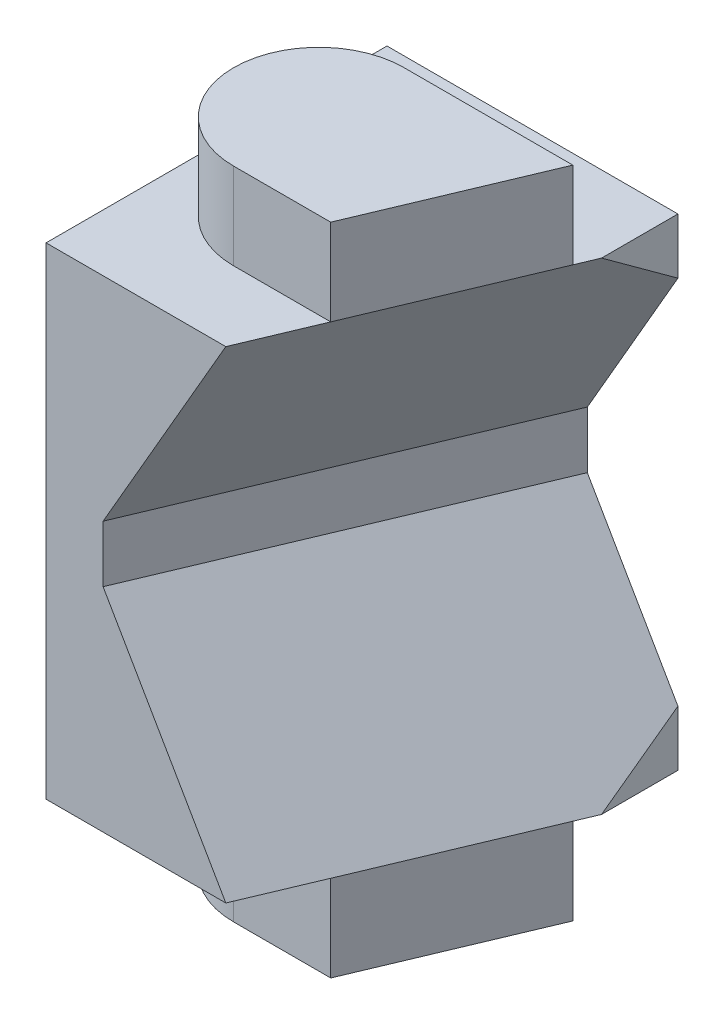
ISO-10303-21;
HEADER;
FILE_DESCRIPTION(('STEP AP214'),'2;1');
FILE_NAME('part.step','',(''),(''),'','','');
FILE_SCHEMA(('AUTOMOTIVE_DESIGN { 1 0 10303 214 1 1 1 1 }'));
ENDSEC;
DATA;
#1=APPLICATION_CONTEXT('core data for automotive mechanical design processes');
#2=APPLICATION_PROTOCOL_DEFINITION('international standard','automotive_design',2000,#1);
#3=PRODUCT_CONTEXT('',#1,'mechanical');
#4=PRODUCT('Part','Part','',(#3));
#5=PRODUCT_RELATED_PRODUCT_CATEGORY('part','',(#4));
#6=PRODUCT_DEFINITION_FORMATION('','',#4);
#7=PRODUCT_DEFINITION_CONTEXT('part definition',#1,'design');
#8=PRODUCT_DEFINITION('design','',#6,#7);
#9=PRODUCT_DEFINITION_SHAPE('','',#8);
#10=(LENGTH_UNIT() NAMED_UNIT(*) SI_UNIT(.MILLI.,.METRE.));
#11=(NAMED_UNIT(*) PLANE_ANGLE_UNIT() SI_UNIT($,.RADIAN.));
#12=(NAMED_UNIT(*) SI_UNIT($,.STERADIAN.) SOLID_ANGLE_UNIT());
#13=UNCERTAINTY_MEASURE_WITH_UNIT(LENGTH_MEASURE(1.E-05),#10,'distance_accuracy_value','');
#14=(GEOMETRIC_REPRESENTATION_CONTEXT(3) GLOBAL_UNCERTAINTY_ASSIGNED_CONTEXT((#13)) GLOBAL_UNIT_ASSIGNED_CONTEXT((#10,
#11,#12)) REPRESENTATION_CONTEXT('',''));
#15=CARTESIAN_POINT('',(0.,0.,0.));
#16=DIRECTION('',(0.,0.,1.));
#17=DIRECTION('',(1.,0.,0.));
#18=AXIS2_PLACEMENT_3D('',#15,#16,#17);
#19=CARTESIAN_POINT('',(0.,10.6,15.));
#20=DIRECTION('',(0.,1.,0.));
#21=DIRECTION('',(1.,0.,0.));
#22=AXIS2_PLACEMENT_3D('',#19,#20,#21);
#23=PLANE('',#22);
#24=CARTESIAN_POINT('',(5.,10.6,8.));
#25=DIRECTION('',(0.,-1.,0.));
#26=DIRECTION('',(-1.,0.,0.));
#27=AXIS2_PLACEMENT_3D('',#24,#25,#26);
#28=CIRCLE('',#27,3.75);
#29=CARTESIAN_POINT('',(5.,10.6,11.75));
#30=VERTEX_POINT('',#29);
#31=CARTESIAN_POINT('',(5.,10.6,4.24999999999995));
#32=VERTEX_POINT('',#31);
#33=EDGE_CURVE('E163',#30,#32,#28,.T.);
#34=ORIENTED_EDGE('',*,*,#33,.T.);
#35=DIRECTION('',(1.,0.,0.));
#36=VECTOR('',#35,1.);
#37=CARTESIAN_POINT('',(5.,10.6,4.24999999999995));
#38=LINE('',#37,#36);
#39=CARTESIAN_POINT('',(12.4259663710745,10.6,4.25));
#40=VERTEX_POINT('',#39);
#41=EDGE_CURVE('E173',#32,#40,#38,.T.);
#42=ORIENTED_EDGE('',*,*,#41,.T.);
#43=DIRECTION('',(-0.38744925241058,0.,0.921891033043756));
#44=VECTOR('',#43,1.);
#45=CARTESIAN_POINT('',(12.8,10.6,3.36002990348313));
#46=LINE('',#45,#44);
#47=CARTESIAN_POINT('',(12.8,10.6,3.36002990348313));
#48=VERTEX_POINT('',#47);
#49=EDGE_CURVE('E247',#48,#40,#46,.T.);
#50=ORIENTED_EDGE('',*,*,#49,.F.);
#51=DIRECTION('',(0.,0.,-1.));
#52=VECTOR('',#51,1.);
#53=CARTESIAN_POINT('',(12.8,10.6,7.35));
#54=LINE('',#53,#52);
#55=CARTESIAN_POINT('',(12.8,10.6,0.));
#56=VERTEX_POINT('',#55);
#57=EDGE_CURVE('E252',#56,#48,#54,.F.);
#58=ORIENTED_EDGE('',*,*,#57,.F.);
#59=DIRECTION('',(1.,0.,0.));
#60=VECTOR('',#59,1.);
#61=CARTESIAN_POINT('',(0.,10.6,0.));
#62=LINE('',#61,#60);
#63=CARTESIAN_POINT('',(0.,10.6,0.));
#64=VERTEX_POINT('',#63);
#65=EDGE_CURVE('E149',#64,#56,#62,.T.);
#66=ORIENTED_EDGE('',*,*,#65,.F.);
#67=DIRECTION('',(0.,0.,-1.));
#68=VECTOR('',#67,1.);
#69=CARTESIAN_POINT('',(0.,10.6,15.));
#70=LINE('',#69,#68);
#71=CARTESIAN_POINT('',(0.,10.6,15.));
#72=VERTEX_POINT('',#71);
#73=EDGE_CURVE('E145',#64,#72,#70,.F.);
#74=ORIENTED_EDGE('',*,*,#73,.T.);
#75=DIRECTION('',(1.,0.,0.));
#76=VECTOR('',#75,1.);
#77=CARTESIAN_POINT('',(0.,10.6,15.));
#78=LINE('',#77,#76);
#79=CARTESIAN_POINT('',(7.90799264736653,10.6,15.));
#80=VERTEX_POINT('',#79);
#81=EDGE_CURVE('E255',#72,#80,#78,.T.);
#82=ORIENTED_EDGE('',*,*,#81,.T.);
#83=CARTESIAN_POINT('',(9.27389168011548,10.6,11.75));
#84=VERTEX_POINT('',#83);
#85=EDGE_CURVE('E250',#84,#80,#46,.T.);
#86=ORIENTED_EDGE('',*,*,#85,.F.);
#87=DIRECTION('',(-1.,0.,0.));
#88=VECTOR('',#87,1.);
#89=CARTESIAN_POINT('',(5.,10.6,11.75));
#90=LINE('',#89,#88);
#91=EDGE_CURVE('E166',#84,#30,#90,.T.);
#92=ORIENTED_EDGE('',*,*,#91,.T.);
#93=EDGE_LOOP('',(#34,#42,#50,#58,#66,#74,#82,#86,#92));
#94=FACE_BOUND('',#93,.T.);
#95=ADVANCED_FACE('F14',(#94),#23,.T.);
#96=CARTESIAN_POINT('',(0.,-10.6,15.));
#97=DIRECTION('',(0.,0.,1.));
#98=DIRECTION('',(-1.,0.,0.));
#99=AXIS2_PLACEMENT_3D('',#96,#97,#98);
#100=PLANE('',#99);
#101=ORIENTED_EDGE('',*,*,#81,.F.);
#102=DIRECTION('',(0.,-1.,0.));
#103=VECTOR('',#102,1.);
#104=CARTESIAN_POINT('',(0.,-10.6,15.));
#105=LINE('',#104,#103);
#106=CARTESIAN_POINT('',(0.,-10.6,15.));
#107=VERTEX_POINT('',#106);
#108=EDGE_CURVE('E222',#72,#107,#105,.T.);
#109=ORIENTED_EDGE('',*,*,#108,.T.);
#110=DIRECTION('',(-1.,0.,0.));
#111=VECTOR('',#110,1.);
#112=CARTESIAN_POINT('',(0.,-10.6,15.));
#113=LINE('',#112,#111);
#114=CARTESIAN_POINT('',(7.90799264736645,-10.6,15.));
#115=VERTEX_POINT('',#114);
#116=EDGE_CURVE('E137',#115,#107,#113,.T.);
#117=ORIENTED_EDGE('',*,*,#116,.F.);
#118=DIRECTION('',(0.5,-0.866025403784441,0.));
#119=VECTOR('',#118,1.);
#120=CARTESIAN_POINT('',(6.9541601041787,-8.94791357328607,15.));
#121=LINE('',#120,#119);
#122=CARTESIAN_POINT('',(2.50847221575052,-1.24775627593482,15.));
#123=VERTEX_POINT('',#122);
#124=EDGE_CURVE('E236',#123,#115,#121,.T.);
#125=ORIENTED_EDGE('',*,*,#124,.F.);
#126=DIRECTION('',(0.,-1.,0.));
#127=VECTOR('',#126,1.);
#128=CARTESIAN_POINT('',(2.5084722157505,-5.92499999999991,15.));
#129=LINE('',#128,#127);
#130=CARTESIAN_POINT('',(2.50847221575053,1.24775627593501,15.));
#131=VERTEX_POINT('',#130);
#132=EDGE_CURVE('E242',#131,#123,#129,.T.);
#133=ORIENTED_EDGE('',*,*,#132,.F.);
#134=DIRECTION('',(-0.5,-0.866025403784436,0.));
#135=VECTOR('',#134,1.);
#136=CARTESIAN_POINT('',(0.434225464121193,-2.34494448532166,15.));
#137=LINE('',#136,#135);
#138=EDGE_CURVE('E245',#80,#131,#137,.T.);
#139=ORIENTED_EDGE('',*,*,#138,.F.);
#140=EDGE_LOOP('',(#101,#109,#117,#125,#133,#139));
#141=FACE_BOUND('',#140,.T.);
#142=ADVANCED_FACE('F285',(#141),#100,.T.);
#143=CARTESIAN_POINT('',(0.,0.,7.35));
#144=DIRECTION('',(1.,0.,0.));
#145=DIRECTION('',(0.,-1.,0.));
#146=AXIS2_PLACEMENT_3D('',#143,#144,#145);
#147=PLANE('',#146);
#148=ORIENTED_EDGE('',*,*,#108,.F.);
#149=ORIENTED_EDGE('',*,*,#73,.F.);
#150=DIRECTION('',(0.,1.,0.));
#151=VECTOR('',#150,1.);
#152=CARTESIAN_POINT('',(0.,-10.6,0.));
#153=LINE('',#152,#151);
#154=CARTESIAN_POINT('',(0.,-10.6,0.));
#155=VERTEX_POINT('',#154);
#156=EDGE_CURVE('E142',#155,#64,#153,.T.);
#157=ORIENTED_EDGE('',*,*,#156,.F.);
#158=DIRECTION('',(0.,0.,-1.));
#159=VECTOR('',#158,1.);
#160=CARTESIAN_POINT('',(0.,-10.6,-0.299999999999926));
#161=LINE('',#160,#159);
#162=EDGE_CURVE('E130',#107,#155,#161,.T.);
#163=ORIENTED_EDGE('',*,*,#162,.F.);
#164=EDGE_LOOP('',(#148,#149,#157,#163));
#165=FACE_BOUND('',#164,.T.);
#166=ADVANCED_FACE('F143',(#165),#147,.F.);
#167=CARTESIAN_POINT('',(12.8,0.,7.35));
#168=DIRECTION('',(1.,0.,0.));
#169=DIRECTION('',(0.,-1.,0.));
#170=AXIS2_PLACEMENT_3D('',#167,#168,#169);
#171=PLANE('',#170);
#172=ORIENTED_EDGE('',*,*,#57,.T.);
#173=DIRECTION('',(0.,0.588524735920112,0.808479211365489));
#174=VECTOR('',#173,1.);
#175=CARTESIAN_POINT('',(12.8,8.29968635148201,0.199999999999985));
#176=LINE('',#175,#174);
#177=CARTESIAN_POINT('',(12.8,8.15409825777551,0.));
#178=VERTEX_POINT('',#177);
#179=EDGE_CURVE('E37',#178,#48,#176,.T.);
#180=ORIENTED_EDGE('',*,*,#179,.F.);
#181=DIRECTION('',(0.,-1.,0.));
#182=VECTOR('',#181,1.);
#183=CARTESIAN_POINT('',(12.8,10.6,0.));
#184=LINE('',#183,#182);
#185=EDGE_CURVE('E159',#56,#178,#184,.T.);
#186=ORIENTED_EDGE('',*,*,#185,.F.);
#187=EDGE_LOOP('',(#172,#180,#186));
#188=FACE_BOUND('',#187,.T.);
#189=ADVANCED_FACE('F337',(#188),#171,.T.);
#190=CARTESIAN_POINT('',(2.84556260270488,-3.73713063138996,7.35));
#191=DIRECTION('',(0.81379768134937,-0.469846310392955,0.342020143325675));
#192=DIRECTION('',(-0.5,-0.866025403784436,0.));
#193=AXIS2_PLACEMENT_3D('',#190,#191,#192);
#194=PLANE('',#193);
#195=ORIENTED_EDGE('',*,*,#138,.T.);
#196=DIRECTION('',(-0.387515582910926,-0.000135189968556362,0.921863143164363));
#197=VECTOR('',#196,1.);
#198=CARTESIAN_POINT('',(8.7298193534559,1.24992667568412,0.20000000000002));
#199=LINE('',#198,#197);
#200=CARTESIAN_POINT('',(8.81389161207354,1.24995600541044,0.));
#201=VERTEX_POINT('',#200);
#202=EDGE_CURVE('E29',#201,#131,#199,.T.);
#203=ORIENTED_EDGE('',*,*,#202,.F.);
#204=DIRECTION('',(0.5,0.866025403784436,0.));
#205=VECTOR('',#204,1.);
#206=CARTESIAN_POINT('',(5.16233750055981,-5.07472124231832,0.));
#207=LINE('',#206,#205);
#208=EDGE_CURVE('E22',#178,#201,#207,.F.);
#209=ORIENTED_EDGE('',*,*,#208,.F.);
#210=ORIENTED_EDGE('',*,*,#179,.T.);
#211=ORIENTED_EDGE('',*,*,#49,.T.);
#212=DIRECTION('',(-0.38744925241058,0.,0.921891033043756));
#213=VECTOR('',#212,1.);
#214=CARTESIAN_POINT('',(12.4259663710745,10.6,4.25));
#215=LINE('',#214,#213);
#216=EDGE_CURVE('E170',#40,#84,#215,.T.);
#217=ORIENTED_EDGE('',*,*,#216,.T.);
#218=ORIENTED_EDGE('',*,*,#85,.T.);
#219=EDGE_LOOP('',(#195,#203,#209,#210,#211,#217,#218));
#220=FACE_BOUND('',#219,.T.);
#221=ADVANCED_FACE('F261',(#220),#194,.T.);
#222=CARTESIAN_POINT('',(5.72423610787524,-5.925,7.35));
#223=DIRECTION('',(0.9218631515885,0.,0.387515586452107));
#224=DIRECTION('',(-0.387515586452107,0.,0.9218631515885));
#225=AXIS2_PLACEMENT_3D('',#222,#223,#224);
#226=PLANE('',#225);
#227=ORIENTED_EDGE('',*,*,#132,.T.);
#228=DIRECTION('',(-0.387515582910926,0.000135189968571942,0.921863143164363));
#229=VECTOR('',#228,1.);
#230=CARTESIAN_POINT('',(8.7298193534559,-1.24992667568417,0.200000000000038));
#231=LINE('',#230,#229);
#232=CARTESIAN_POINT('',(8.81389161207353,-1.24995600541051,0.));
#233=VERTEX_POINT('',#232);
#234=EDGE_CURVE('E239',#233,#123,#231,.T.);
#235=ORIENTED_EDGE('',*,*,#234,.F.);
#236=DIRECTION('',(0.,1.,0.));
#237=VECTOR('',#236,1.);
#238=CARTESIAN_POINT('',(8.81389161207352,-5.925,0.));
#239=LINE('',#238,#237);
#240=EDGE_CURVE('E9',#201,#233,#239,.F.);
#241=ORIENTED_EDGE('',*,*,#240,.F.);
#242=ORIENTED_EDGE('',*,*,#202,.T.);
#243=EDGE_LOOP('',(#227,#235,#241,#242));
#244=FACE_BOUND('',#243,.T.);
#245=ADVANCED_FACE('F287',(#244),#226,.T.);
#246=CARTESIAN_POINT('',(9.36549724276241,-7.55572742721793,7.35000000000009));
#247=DIRECTION('',(0.813797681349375,0.469846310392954,0.342020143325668));
#248=DIRECTION('',(0.5,-0.866025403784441,0.));
#249=AXIS2_PLACEMENT_3D('',#246,#247,#248);
#250=PLANE('',#249);
#251=DIRECTION('',(-0.38744925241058,0.,0.921891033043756));
#252=VECTOR('',#251,1.);
#253=CARTESIAN_POINT('',(12.8,-10.6,3.36002990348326));
#254=LINE('',#253,#252);
#255=CARTESIAN_POINT('',(12.8,-10.6,3.36002990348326));
#256=VERTEX_POINT('',#255);
#257=CARTESIAN_POINT('',(12.4259663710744,-10.6,4.25000000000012));
#258=VERTEX_POINT('',#257);
#259=EDGE_CURVE('E229',#256,#258,#254,.T.);
#260=ORIENTED_EDGE('',*,*,#259,.F.);
#261=DIRECTION('',(0.,-0.588524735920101,0.808479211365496));
#262=VECTOR('',#261,1.);
#263=CARTESIAN_POINT('',(12.8,-8.29968635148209,0.200000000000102));
#264=LINE('',#263,#262);
#265=CARTESIAN_POINT('',(12.8,-8.15409825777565,1.01630724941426E-13));
#266=VERTEX_POINT('',#265);
#267=EDGE_CURVE('E234',#266,#256,#264,.T.);
#268=ORIENTED_EDGE('',*,*,#267,.F.);
#269=DIRECTION('',(0.5,-0.866025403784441,0.));
#270=VECTOR('',#269,1.);
#271=CARTESIAN_POINT('',(1.47923724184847,11.4540380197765,0.));
#272=LINE('',#271,#270);
#273=EDGE_CURVE('E139',#266,#233,#272,.F.);
#274=ORIENTED_EDGE('',*,*,#273,.T.);
#275=ORIENTED_EDGE('',*,*,#234,.T.);
#276=ORIENTED_EDGE('',*,*,#124,.T.);
#277=CARTESIAN_POINT('',(9.27389168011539,-10.6,11.75));
#278=VERTEX_POINT('',#277);
#279=EDGE_CURVE('E231',#278,#115,#254,.T.);
#280=ORIENTED_EDGE('',*,*,#279,.F.);
#281=DIRECTION('',(-0.38744925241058,0.,0.921891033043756));
#282=VECTOR('',#281,1.);
#283=CARTESIAN_POINT('',(12.4259663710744,-10.6,4.25000000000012));
#284=LINE('',#283,#282);
#285=EDGE_CURVE('E203',#258,#278,#284,.T.);
#286=ORIENTED_EDGE('',*,*,#285,.F.);
#287=EDGE_LOOP('',(#260,#268,#274,#275,#276,#280,#286));
#288=FACE_BOUND('',#287,.T.);
#289=ADVANCED_FACE('F290',(#288),#250,.T.);
#290=ORIENTED_EDGE('',*,*,#267,.T.);
#291=DIRECTION('',(0.,0.,-1.));
#292=VECTOR('',#291,1.);
#293=CARTESIAN_POINT('',(12.8,-10.6,-0.299999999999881));
#294=LINE('',#293,#292);
#295=CARTESIAN_POINT('',(12.8,-10.6,1.18710365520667E-13));
#296=VERTEX_POINT('',#295);
#297=EDGE_CURVE('E232',#296,#256,#294,.F.);
#298=ORIENTED_EDGE('',*,*,#297,.F.);
#299=DIRECTION('',(0.,-1.,0.));
#300=VECTOR('',#299,1.);
#301=CARTESIAN_POINT('',(12.8,-8.2996863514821,1.02647361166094E-13));
#302=LINE('',#301,#300);
#303=EDGE_CURVE('E155',#266,#296,#302,.T.);
#304=ORIENTED_EDGE('',*,*,#303,.F.);
#305=EDGE_LOOP('',(#290,#298,#304));
#306=FACE_BOUND('',#305,.T.);
#307=ADVANCED_FACE('F294',(#306),#171,.T.);
#308=CARTESIAN_POINT('',(0.,-10.6,-0.299999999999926));
#309=DIRECTION('',(0.,-1.,0.));
#310=DIRECTION('',(-1.,0.,0.));
#311=AXIS2_PLACEMENT_3D('',#308,#309,#310);
#312=PLANE('',#311);
#313=DIRECTION('',(-1.,0.,0.));
#314=VECTOR('',#313,1.);
#315=CARTESIAN_POINT('',(4.99999999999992,-10.6,11.75));
#316=LINE('',#315,#314);
#317=CARTESIAN_POINT('',(4.99999999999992,-10.6,11.75));
#318=VERTEX_POINT('',#317);
#319=EDGE_CURVE('E206',#278,#318,#316,.T.);
#320=ORIENTED_EDGE('',*,*,#319,.F.);
#321=ORIENTED_EDGE('',*,*,#279,.T.);
#322=ORIENTED_EDGE('',*,*,#116,.T.);
#323=ORIENTED_EDGE('',*,*,#162,.T.);
#324=DIRECTION('',(-1.,0.,0.));
#325=VECTOR('',#324,1.);
#326=CARTESIAN_POINT('',(12.8,-10.6,1.18710365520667E-13));
#327=LINE('',#326,#325);
#328=EDGE_CURVE('E135',#296,#155,#327,.T.);
#329=ORIENTED_EDGE('',*,*,#328,.F.);
#330=ORIENTED_EDGE('',*,*,#297,.T.);
#331=ORIENTED_EDGE('',*,*,#259,.T.);
#332=DIRECTION('',(1.,0.,0.));
#333=VECTOR('',#332,1.);
#334=CARTESIAN_POINT('',(5.,-10.6,4.25000000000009));
#335=LINE('',#334,#333);
#336=CARTESIAN_POINT('',(5.,-10.6,4.25000000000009));
#337=VERTEX_POINT('',#336);
#338=EDGE_CURVE('E199',#337,#258,#335,.T.);
#339=ORIENTED_EDGE('',*,*,#338,.F.);
#340=CARTESIAN_POINT('',(4.99999999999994,-10.6,8.00000000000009));
#341=DIRECTION('',(0.,-1.,0.));
#342=DIRECTION('',(-1.,0.,0.));
#343=AXIS2_PLACEMENT_3D('',#340,#341,#342);
#344=CIRCLE('',#343,3.75);
#345=EDGE_CURVE('E196',#318,#337,#344,.T.);
#346=ORIENTED_EDGE('',*,*,#345,.F.);
#347=EDGE_LOOP('',(#320,#321,#322,#323,#329,#330,#331,#339,#346));
#348=FACE_BOUND('',#347,.T.);
#349=ADVANCED_FACE('F132',(#348),#312,.T.);
#350=CARTESIAN_POINT('',(4.99999999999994,-10.6,8.00000000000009));
#351=DIRECTION('',(0.,-1.,0.));
#352=DIRECTION('',(-1.,0.,0.));
#353=AXIS2_PLACEMENT_3D('',#350,#351,#352);
#354=CYLINDRICAL_SURFACE('',#353,3.75);
#355=CARTESIAN_POINT('',(4.99999999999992,-14.4,8.00000000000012));
#356=DIRECTION('',(0.,-1.,0.));
#357=DIRECTION('',(-1.,0.,0.));
#358=AXIS2_PLACEMENT_3D('',#355,#356,#357);
#359=CIRCLE('',#358,3.75);
#360=CARTESIAN_POINT('',(4.99999999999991,-14.4,11.7500000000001));
#361=VERTEX_POINT('',#360);
#362=CARTESIAN_POINT('',(4.99999999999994,-14.4,4.25000000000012));
#363=VERTEX_POINT('',#362);
#364=EDGE_CURVE('E187',#361,#363,#359,.T.);
#365=ORIENTED_EDGE('',*,*,#364,.F.);
#366=DIRECTION('',(0.,-1.,0.));
#367=VECTOR('',#366,1.);
#368=CARTESIAN_POINT('',(4.99999999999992,-10.6,11.75));
#369=LINE('',#368,#367);
#370=EDGE_CURVE('E220',#318,#361,#369,.T.);
#371=ORIENTED_EDGE('',*,*,#370,.F.);
#372=ORIENTED_EDGE('',*,*,#345,.T.);
#373=DIRECTION('',(0.,-1.,0.));
#374=VECTOR('',#373,1.);
#375=CARTESIAN_POINT('',(5.,-10.6,4.25000000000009));
#376=LINE('',#375,#374);
#377=EDGE_CURVE('E209',#337,#363,#376,.T.);
#378=ORIENTED_EDGE('',*,*,#377,.T.);
#379=EDGE_LOOP('',(#365,#371,#372,#378));
#380=FACE_BOUND('',#379,.T.);
#381=ADVANCED_FACE('F307',(#380),#354,.T.);
#382=CARTESIAN_POINT('',(4.99999999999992,-10.6,11.75));
#383=DIRECTION('',(0.,0.,1.));
#384=DIRECTION('',(-1.,0.,0.));
#385=AXIS2_PLACEMENT_3D('',#382,#383,#384);
#386=PLANE('',#385);
#387=DIRECTION('',(-1.,0.,0.));
#388=VECTOR('',#387,1.);
#389=CARTESIAN_POINT('',(4.99999999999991,-14.4,11.7500000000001));
#390=LINE('',#389,#388);
#391=CARTESIAN_POINT('',(9.27389168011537,-14.4,11.7500000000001));
#392=VERTEX_POINT('',#391);
#393=EDGE_CURVE('E200',#392,#361,#390,.T.);
#394=ORIENTED_EDGE('',*,*,#393,.F.);
#395=DIRECTION('',(0.,-1.,0.));
#396=VECTOR('',#395,1.);
#397=CARTESIAN_POINT('',(9.27389168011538,-10.6,11.75));
#398=LINE('',#397,#396);
#399=EDGE_CURVE('E223',#278,#392,#398,.T.);
#400=ORIENTED_EDGE('',*,*,#399,.F.);
#401=ORIENTED_EDGE('',*,*,#319,.T.);
#402=ORIENTED_EDGE('',*,*,#370,.T.);
#403=EDGE_LOOP('',(#394,#400,#401,#402));
#404=FACE_BOUND('',#403,.T.);
#405=ADVANCED_FACE('F310',(#404),#386,.T.);
#406=CARTESIAN_POINT('',(12.4259663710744,-10.6,4.25000000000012));
#407=DIRECTION('',(0.921891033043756,0.,0.387449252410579));
#408=DIRECTION('',(-0.387449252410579,0.,0.921891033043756));
#409=AXIS2_PLACEMENT_3D('',#406,#407,#408);
#410=PLANE('',#409);
#411=DIRECTION('',(-0.38744925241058,0.,0.921891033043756));
#412=VECTOR('',#411,1.);
#413=CARTESIAN_POINT('',(12.4259663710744,-14.4,4.25000000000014));
#414=LINE('',#413,#412);
#415=CARTESIAN_POINT('',(12.4259663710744,-14.4,4.25000000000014));
#416=VERTEX_POINT('',#415);
#417=EDGE_CURVE('E215',#416,#392,#414,.T.);
#418=ORIENTED_EDGE('',*,*,#417,.F.);
#419=DIRECTION('',(0.,-1.,0.));
#420=VECTOR('',#419,1.);
#421=CARTESIAN_POINT('',(12.4259663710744,-10.6,4.25000000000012));
#422=LINE('',#421,#420);
#423=EDGE_CURVE('E225',#258,#416,#422,.T.);
#424=ORIENTED_EDGE('',*,*,#423,.F.);
#425=ORIENTED_EDGE('',*,*,#285,.T.);
#426=ORIENTED_EDGE('',*,*,#399,.T.);
#427=EDGE_LOOP('',(#418,#424,#425,#426));
#428=FACE_BOUND('',#427,.T.);
#429=ADVANCED_FACE('F300',(#428),#410,.T.);
#430=CARTESIAN_POINT('',(5.,-10.6,4.25000000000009));
#431=DIRECTION('',(0.,0.,-1.));
#432=DIRECTION('',(1.,0.,0.));
#433=AXIS2_PLACEMENT_3D('',#430,#431,#432);
#434=PLANE('',#433);
#435=DIRECTION('',(1.,0.,0.));
#436=VECTOR('',#435,1.);
#437=CARTESIAN_POINT('',(4.99999999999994,-14.4,4.25000000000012));
#438=LINE('',#437,#436);
#439=EDGE_CURVE('E212',#363,#416,#438,.T.);
#440=ORIENTED_EDGE('',*,*,#439,.F.);
#441=ORIENTED_EDGE('',*,*,#377,.F.);
#442=ORIENTED_EDGE('',*,*,#338,.T.);
#443=ORIENTED_EDGE('',*,*,#423,.T.);
#444=EDGE_LOOP('',(#440,#441,#442,#443));
#445=FACE_BOUND('',#444,.T.);
#446=ADVANCED_FACE('F303',(#445),#434,.T.);
#447=CARTESIAN_POINT('',(4.98939776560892,-14.4,8.00000000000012));
#448=DIRECTION('',(0.,-1.,0.));
#449=DIRECTION('',(-1.,0.,0.));
#450=AXIS2_PLACEMENT_3D('',#447,#448,#449);
#451=PLANE('',#450);
#452=ORIENTED_EDGE('',*,*,#364,.T.);
#453=ORIENTED_EDGE('',*,*,#439,.T.);
#454=ORIENTED_EDGE('',*,*,#417,.T.);
#455=ORIENTED_EDGE('',*,*,#393,.T.);
#456=EDGE_LOOP('',(#452,#453,#454,#455));
#457=FACE_BOUND('',#456,.T.);
#458=ADVANCED_FACE('F312',(#457),#451,.T.);
#459=CARTESIAN_POINT('',(5.,10.6,8.));
#460=DIRECTION('',(0.,1.,0.));
#461=DIRECTION('',(1.,0.,0.));
#462=AXIS2_PLACEMENT_3D('',#459,#460,#461);
#463=CYLINDRICAL_SURFACE('',#462,3.75);
#464=CARTESIAN_POINT('',(5.,14.4,8.));
#465=DIRECTION('',(0.,-1.,0.));
#466=DIRECTION('',(-1.,0.,0.));
#467=AXIS2_PLACEMENT_3D('',#464,#465,#466);
#468=CIRCLE('',#467,3.75);
#469=CARTESIAN_POINT('',(5.,14.4,11.75));
#470=VERTEX_POINT('',#469);
#471=CARTESIAN_POINT('',(5.,14.4,4.24999999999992));
#472=VERTEX_POINT('',#471);
#473=EDGE_CURVE('E162',#470,#472,#468,.T.);
#474=ORIENTED_EDGE('',*,*,#473,.T.);
#475=DIRECTION('',(0.,1.,0.));
#476=VECTOR('',#475,1.);
#477=CARTESIAN_POINT('',(5.,10.6,4.24999999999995));
#478=LINE('',#477,#476);
#479=EDGE_CURVE('E184',#32,#472,#478,.T.);
#480=ORIENTED_EDGE('',*,*,#479,.F.);
#481=ORIENTED_EDGE('',*,*,#33,.F.);
#482=DIRECTION('',(0.,1.,0.));
#483=VECTOR('',#482,1.);
#484=CARTESIAN_POINT('',(5.,10.6,11.75));
#485=LINE('',#484,#483);
#486=EDGE_CURVE('E176',#30,#470,#485,.T.);
#487=ORIENTED_EDGE('',*,*,#486,.T.);
#488=EDGE_LOOP('',(#474,#480,#481,#487));
#489=FACE_BOUND('',#488,.T.);
#490=ADVANCED_FACE('F270',(#489),#463,.T.);
#491=CARTESIAN_POINT('',(5.,10.6,4.24999999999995));
#492=DIRECTION('',(0.,0.,1.));
#493=DIRECTION('',(-1.,0.,0.));
#494=AXIS2_PLACEMENT_3D('',#491,#492,#493);
#495=PLANE('',#494);
#496=DIRECTION('',(1.,0.,0.));
#497=VECTOR('',#496,1.);
#498=CARTESIAN_POINT('',(5.,14.4,4.24999999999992));
#499=LINE('',#498,#497);
#500=CARTESIAN_POINT('',(12.4259663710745,14.4,4.24999999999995));
#501=VERTEX_POINT('',#500);
#502=EDGE_CURVE('E167',#472,#501,#499,.T.);
#503=ORIENTED_EDGE('',*,*,#502,.T.);
#504=DIRECTION('',(0.,1.,0.));
#505=VECTOR('',#504,1.);
#506=CARTESIAN_POINT('',(12.4259663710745,10.6,4.25));
#507=LINE('',#506,#505);
#508=EDGE_CURVE('E188',#40,#501,#507,.T.);
#509=ORIENTED_EDGE('',*,*,#508,.F.);
#510=ORIENTED_EDGE('',*,*,#41,.F.);
#511=ORIENTED_EDGE('',*,*,#479,.T.);
#512=EDGE_LOOP('',(#503,#509,#510,#511));
#513=FACE_BOUND('',#512,.T.);
#514=ADVANCED_FACE('F268',(#513),#495,.F.);
#515=CARTESIAN_POINT('',(12.4259663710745,10.6,4.25));
#516=DIRECTION('',(-0.921891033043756,0.,-0.387449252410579));
#517=DIRECTION('',(0.387449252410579,0.,-0.921891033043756));
#518=AXIS2_PLACEMENT_3D('',#515,#516,#517);
#519=PLANE('',#518);
#520=DIRECTION('',(-0.38744925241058,0.,0.921891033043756));
#521=VECTOR('',#520,1.);
#522=CARTESIAN_POINT('',(12.4259663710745,14.4,4.24999999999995));
#523=LINE('',#522,#521);
#524=CARTESIAN_POINT('',(9.27389168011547,14.4,11.75));
#525=VERTEX_POINT('',#524);
#526=EDGE_CURVE('E181',#501,#525,#523,.T.);
#527=ORIENTED_EDGE('',*,*,#526,.T.);
#528=DIRECTION('',(0.,1.,0.));
#529=VECTOR('',#528,1.);
#530=CARTESIAN_POINT('',(9.27389168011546,10.6,11.75));
#531=LINE('',#530,#529);
#532=EDGE_CURVE('E191',#84,#525,#531,.T.);
#533=ORIENTED_EDGE('',*,*,#532,.F.);
#534=ORIENTED_EDGE('',*,*,#216,.F.);
#535=ORIENTED_EDGE('',*,*,#508,.T.);
#536=EDGE_LOOP('',(#527,#533,#534,#535));
#537=FACE_BOUND('',#536,.T.);
#538=ADVANCED_FACE('F276',(#537),#519,.F.);
#539=CARTESIAN_POINT('',(5.,10.6,11.75));
#540=DIRECTION('',(0.,0.,-1.));
#541=DIRECTION('',(1.,0.,0.));
#542=AXIS2_PLACEMENT_3D('',#539,#540,#541);
#543=PLANE('',#542);
#544=DIRECTION('',(-1.,0.,0.));
#545=VECTOR('',#544,1.);
#546=CARTESIAN_POINT('',(5.,14.4,11.75));
#547=LINE('',#546,#545);
#548=EDGE_CURVE('E179',#525,#470,#547,.T.);
#549=ORIENTED_EDGE('',*,*,#548,.T.);
#550=ORIENTED_EDGE('',*,*,#486,.F.);
#551=ORIENTED_EDGE('',*,*,#91,.F.);
#552=ORIENTED_EDGE('',*,*,#532,.T.);
#553=EDGE_LOOP('',(#549,#550,#551,#552));
#554=FACE_BOUND('',#553,.T.);
#555=ADVANCED_FACE('F402',(#554),#543,.F.);
#556=CARTESIAN_POINT('',(6.8,14.4,5.79999999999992));
#557=DIRECTION('',(0.,1.,0.));
#558=DIRECTION('',(-1.,0.,0.));
#559=AXIS2_PLACEMENT_3D('',#556,#557,#558);
#560=PLANE('',#559);
#561=ORIENTED_EDGE('',*,*,#473,.F.);
#562=ORIENTED_EDGE('',*,*,#548,.F.);
#563=ORIENTED_EDGE('',*,*,#526,.F.);
#564=ORIENTED_EDGE('',*,*,#502,.F.);
#565=EDGE_LOOP('',(#561,#562,#563,#564));
#566=FACE_BOUND('',#565,.T.);
#567=ADVANCED_FACE('F16',(#566),#560,.T.);
#568=CARTESIAN_POINT('',(0.,10.6,0.));
#569=DIRECTION('',(0.,0.,-1.));
#570=DIRECTION('',(1.,0.,0.));
#571=AXIS2_PLACEMENT_3D('',#568,#569,#570);
#572=PLANE('',#571);
#573=ORIENTED_EDGE('',*,*,#273,.F.);
#574=ORIENTED_EDGE('',*,*,#303,.T.);
#575=ORIENTED_EDGE('',*,*,#328,.T.);
#576=ORIENTED_EDGE('',*,*,#156,.T.);
#577=ORIENTED_EDGE('',*,*,#65,.T.);
#578=ORIENTED_EDGE('',*,*,#185,.T.);
#579=ORIENTED_EDGE('',*,*,#208,.T.);
#580=ORIENTED_EDGE('',*,*,#240,.T.);
#581=EDGE_LOOP('',(#573,#574,#575,#576,#577,#578,#579,#580));
#582=FACE_BOUND('',#581,.T.);
#583=ADVANCED_FACE('F153',(#582),#572,.T.);
#584=CLOSED_SHELL('',(#95,#142,#166,#189,#221,#245,#289,#307,#349,#381,#405,#429,#446,#458,#490,
#514,#538,#555,#567,#583));
#585=MANIFOLD_SOLID_BREP('B1',#584);
#586=ADVANCED_BREP_SHAPE_REPRESENTATION('',(#18,#585),#14);
#587=SHAPE_DEFINITION_REPRESENTATION(#9,#586);
ENDSEC;
END-ISO-10303-21;
